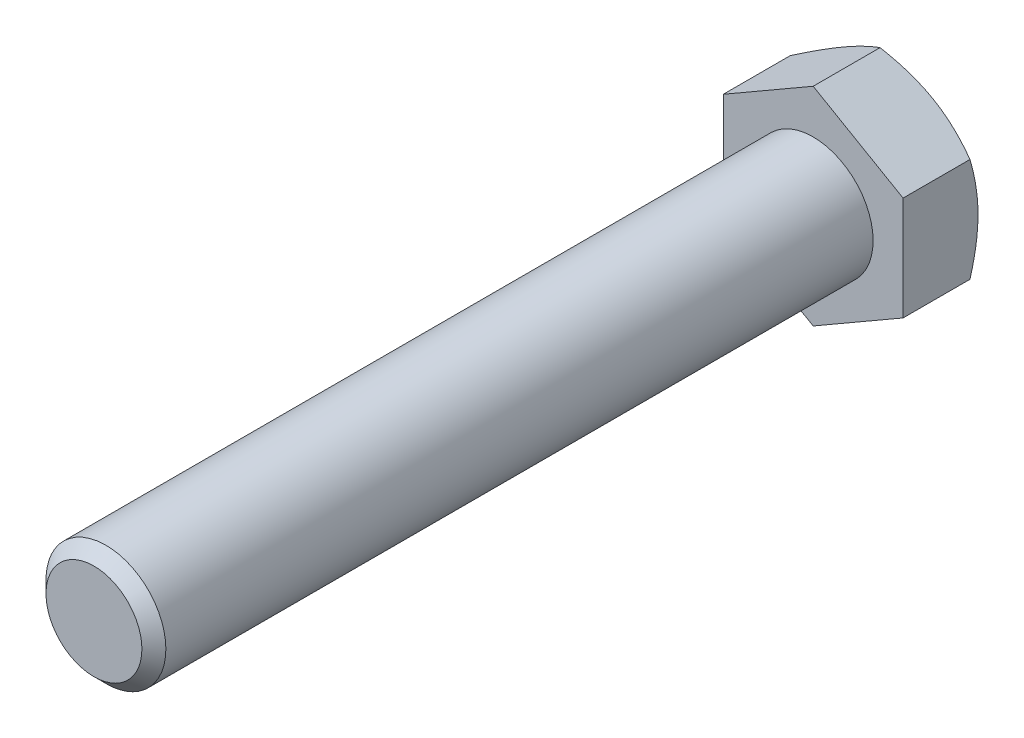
from build123d import *

# Parameters (mm, degrees)
ESQUISSE1_W        = 10
ESQUISSE1_H        = 120
CHANFREIN1_SIZE    = 2
BOSS_EXTRU_1_DEPTH = 12.5


with BuildPart() as part:
    # Esquisse1 → Base-R_volution (revolve)
    with BuildSketch(Plane(origin=(0, 0, 0), x_dir=(1, 0, 0), z_dir=(0, 1, 0))):
        with Locations((5, -60)):
            Rectangle(ESQUISSE1_W, ESQUISSE1_H)
    revolve(axis=Axis((0, 0, 0), (0, 0, 1)))

    # Chanfrein1
    chanfrein1_edges = [part.edges().sort_by_distance(p)[0] for p in [
        (-10, 0, 120),
    ]]
    chamfer(chanfrein1_edges, length=CHANFREIN1_SIZE)

    # Esquisse6 → Boss.-Extru.1 (add)
    with BuildSketch(Plane.XY):
        Polygon((15, -8.660254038), (15, 8.660254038), (0, 17.320508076), (-15, 8.660254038), (-15, -8.660254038), (0, -17.320508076), align=None)
    extrude(amount=-BOSS_EXTRU_1_DEPTH)

    # Esquisse7 → Enl_vement de mati_re-R_volution1 (revolve, cut)
    with BuildSketch(Plane(origin=(0, 0, 0), x_dir=(1, 0, 0), z_dir=(0, 1, 0))):
        Polygon((-15, 12.5), (-36.650635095, 12.5), (-36.650635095, 0), align=None)
    revolve(axis=Axis((0, 0, -6.239446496), (0, 0, 1)), mode=Mode.SUBTRACT)


solid = part.part
